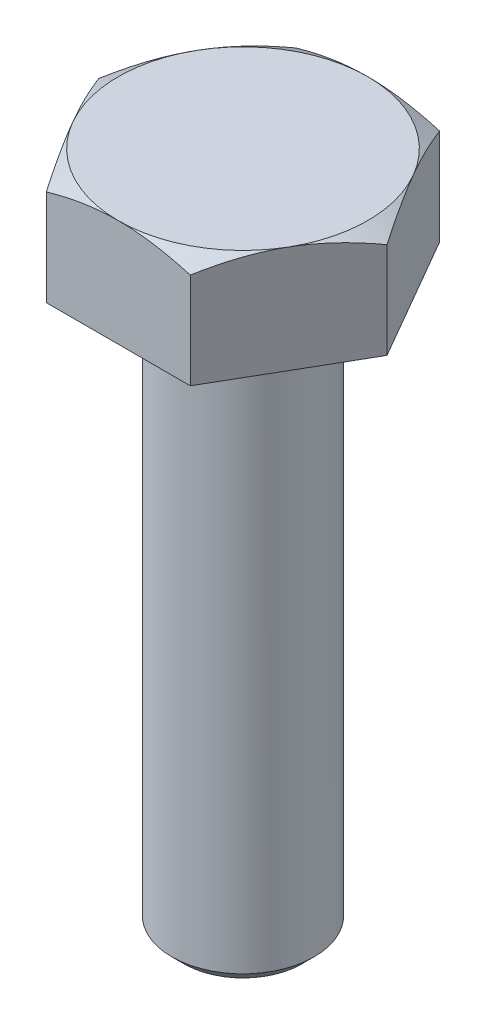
ISO-10303-21;
HEADER;
FILE_DESCRIPTION(('STEP AP214'),'2;1');
FILE_NAME('part.step','',(''),(''),'','','');
FILE_SCHEMA(('AUTOMOTIVE_DESIGN { 1 0 10303 214 1 1 1 1 }'));
ENDSEC;
DATA;
#1=APPLICATION_CONTEXT('core data for automotive mechanical design processes');
#2=APPLICATION_PROTOCOL_DEFINITION('international standard','automotive_design',2000,#1);
#3=PRODUCT_CONTEXT('',#1,'mechanical');
#4=PRODUCT('Part','Part','',(#3));
#5=PRODUCT_RELATED_PRODUCT_CATEGORY('part','',(#4));
#6=PRODUCT_DEFINITION_FORMATION('','',#4);
#7=PRODUCT_DEFINITION_CONTEXT('part definition',#1,'design');
#8=PRODUCT_DEFINITION('design','',#6,#7);
#9=PRODUCT_DEFINITION_SHAPE('','',#8);
#10=(LENGTH_UNIT() NAMED_UNIT(*) SI_UNIT(.MILLI.,.METRE.));
#11=(NAMED_UNIT(*) PLANE_ANGLE_UNIT() SI_UNIT($,.RADIAN.));
#12=(NAMED_UNIT(*) SI_UNIT($,.STERADIAN.) SOLID_ANGLE_UNIT());
#13=UNCERTAINTY_MEASURE_WITH_UNIT(LENGTH_MEASURE(1.E-05),#10,'distance_accuracy_value','');
#14=(GEOMETRIC_REPRESENTATION_CONTEXT(3) GLOBAL_UNCERTAINTY_ASSIGNED_CONTEXT((#13)) GLOBAL_UNIT_ASSIGNED_CONTEXT((#10,
#11,#12)) REPRESENTATION_CONTEXT('',''));
#15=CARTESIAN_POINT('',(0.,0.,0.));
#16=DIRECTION('',(0.,0.,1.));
#17=DIRECTION('',(1.,0.,0.));
#18=AXIS2_PLACEMENT_3D('',#15,#16,#17);
#19=CARTESIAN_POINT('',(0.,-25.4,0.));
#20=DIRECTION('',(0.,1.,0.));
#21=DIRECTION('',(0.,0.,1.));
#22=AXIS2_PLACEMENT_3D('',#19,#20,#21);
#23=CYLINDRICAL_SURFACE('',#22,3.175);
#24=CARTESIAN_POINT('',(0.,0.,0.));
#25=DIRECTION('',(0.,1.,0.));
#26=DIRECTION('',(0.,0.,1.));
#27=AXIS2_PLACEMENT_3D('',#24,#25,#26);
#28=CIRCLE('',#27,3.175);
#29=CARTESIAN_POINT('',(0.,0.,3.175));
#30=VERTEX_POINT('',#29);
#31=EDGE_CURVE('E12',#30,#30,#28,.F.);
#32=ORIENTED_EDGE('',*,*,#31,.T.);
#33=EDGE_LOOP('',(#32));
#34=FACE_BOUND('',#33,.T.);
#35=CARTESIAN_POINT('',(0.,-24.8588701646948,0.));
#36=DIRECTION('',(0.,1.,0.));
#37=DIRECTION('',(0.,0.,1.));
#38=AXIS2_PLACEMENT_3D('',#35,#36,#37);
#39=CIRCLE('',#38,3.175);
#40=CARTESIAN_POINT('',(0.,-24.8588701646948,3.175));
#41=VERTEX_POINT('',#40);
#42=EDGE_CURVE('E133',#41,#41,#39,.F.);
#43=ORIENTED_EDGE('',*,*,#42,.F.);
#44=EDGE_LOOP('',(#43));
#45=FACE_BOUND('',#44,.T.);
#46=ADVANCED_FACE('F38',(#34,#45),#23,.T.);
#47=CARTESIAN_POINT('',(3.21156860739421,4.7752,5.5626));
#48=DIRECTION('',(-0.866025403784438,0.,-0.5));
#49=DIRECTION('',(-0.5,0.,0.866025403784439));
#50=AXIS2_PLACEMENT_3D('',#47,#48,#49);
#51=PLANE('',#50);
#52=CARTESIAN_POINT('',(3.21145313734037,4.27830193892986,5.5628));
#53=CARTESIAN_POINT('',(3.28204724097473,4.31905379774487,5.44052742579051));
#54=CARTESIAN_POINT('',(3.35290455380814,4.35795622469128,5.31779895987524));
#55=CARTESIAN_POINT('',(3.49519461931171,4.43155283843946,5.07134533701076));
#56=CARTESIAN_POINT('',(3.56662760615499,4.46624520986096,4.9476197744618));
#57=CARTESIAN_POINT('',(3.78207031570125,4.56332629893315,4.57446205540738));
#58=CARTESIAN_POINT('',(3.92693047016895,4.61854515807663,4.32355690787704));
#59=CARTESIAN_POINT('',(4.14371105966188,4.68329621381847,3.94808191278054));
#60=CARTESIAN_POINT('',(4.21498376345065,4.70174200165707,3.8246339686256));
#61=CARTESIAN_POINT('',(4.3578512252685,4.73267310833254,3.57718026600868));
#62=CARTESIAN_POINT('',(4.42944595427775,4.74515895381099,3.45317455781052));
#63=CARTESIAN_POINT('',(4.57275976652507,4.76385197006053,3.20494775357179));
#64=CARTESIAN_POINT('',(4.64447861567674,4.77006626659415,3.08072706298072));
#65=CARTESIAN_POINT('',(4.78797861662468,4.7760895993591,2.8321777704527));
#66=CARTESIAN_POINT('',(4.85975976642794,4.7758988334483,2.70784917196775));
#67=CARTESIAN_POINT('',(5.05641945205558,4.76657189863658,2.36722460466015));
#68=CARTESIAN_POINT('',(5.18123362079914,4.75091260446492,2.15104012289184));
#69=CARTESIAN_POINT('',(5.4300329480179,4.70125567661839,1.72010704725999));
#70=CARTESIAN_POINT('',(5.55401723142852,4.66724106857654,1.50535996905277));
#71=CARTESIAN_POINT('',(5.80331731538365,4.58221395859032,1.0735595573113));
#72=CARTESIAN_POINT('',(5.92860165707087,4.5308411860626,0.856560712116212));
#73=CARTESIAN_POINT('',(6.17730193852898,4.4142455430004,0.425799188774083));
#74=CARTESIAN_POINT('',(6.30072106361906,4.34905006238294,0.212030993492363));
#75=CARTESIAN_POINT('',(6.42325268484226,4.27830193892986,-0.000199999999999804));
#76=B_SPLINE_CURVE_WITH_KNOTS('',3,(#52,#53,#54,#55,#56,#57,#58,#59,#60,#61,#62,#63,#64,#65,#66,
#67,#68,#69,#70,#71,#72,#73,#74,#75),.UNSPECIFIED.,.F.,.F.,(4,2,2,2,2,2,2,2,2,2,2,4),(0.,
0.44082011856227,0.881829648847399,1.76568130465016,2.19678242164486,2.62784543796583,
3.05841812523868,3.48897751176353,4.23854798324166,4.98881282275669,5.75571809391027,
6.52111769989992),.UNSPECIFIED.);
#77=CARTESIAN_POINT('',(3.21156860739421,4.27836860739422,5.5626));
#78=VERTEX_POINT('',#77);
#79=CARTESIAN_POINT('',(4.81735291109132,4.7752,2.7813));
#80=VERTEX_POINT('',#79);
#81=EDGE_CURVE('E113',#78,#80,#76,.T.);
#82=ORIENTED_EDGE('',*,*,#81,.F.);
#83=DIRECTION('',(0.,-1.,0.));
#84=VECTOR('',#83,1.);
#85=CARTESIAN_POINT('',(3.21156860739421,4.7752,5.5626));
#86=LINE('',#85,#84);
#87=CARTESIAN_POINT('',(3.21156860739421,0.,5.5626));
#88=VERTEX_POINT('',#87);
#89=EDGE_CURVE('E62',#78,#88,#86,.T.);
#90=ORIENTED_EDGE('',*,*,#89,.T.);
#91=DIRECTION('',(0.5,0.,-0.866025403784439));
#92=VECTOR('',#91,1.);
#93=CARTESIAN_POINT('',(3.21156860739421,0.,5.5626));
#94=LINE('',#93,#92);
#95=CARTESIAN_POINT('',(6.42313721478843,0.,0.));
#96=VERTEX_POINT('',#95);
#97=EDGE_CURVE('E120',#88,#96,#94,.T.);
#98=ORIENTED_EDGE('',*,*,#97,.T.);
#99=DIRECTION('',(0.,-1.,0.));
#100=VECTOR('',#99,1.);
#101=CARTESIAN_POINT('',(6.42313721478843,4.7752,0.));
#102=LINE('',#101,#100);
#103=CARTESIAN_POINT('',(6.42313721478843,4.27836860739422,0.));
#104=VERTEX_POINT('',#103);
#105=EDGE_CURVE('E136',#104,#96,#102,.T.);
#106=ORIENTED_EDGE('',*,*,#105,.F.);
#107=EDGE_CURVE('E121',#80,#104,#76,.T.);
#108=ORIENTED_EDGE('',*,*,#107,.F.);
#109=EDGE_LOOP('',(#82,#90,#98,#106,#108));
#110=FACE_BOUND('',#109,.T.);
#111=ADVANCED_FACE('F40',(#110),#51,.F.);
#112=CARTESIAN_POINT('',(6.42313721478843,4.7752,0.));
#113=DIRECTION('',(-0.866025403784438,0.,0.5));
#114=DIRECTION('',(0.5,0.,0.866025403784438));
#115=AXIS2_PLACEMENT_3D('',#112,#113,#114);
#116=PLANE('',#115);
#117=CARTESIAN_POINT('',(6.42325268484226,4.27830193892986,0.000200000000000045));
#118=CARTESIAN_POINT('',(6.35265858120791,4.31905379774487,-0.122072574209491));
#119=CARTESIAN_POINT('',(6.28180126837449,4.35795622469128,-0.244801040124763));
#120=CARTESIAN_POINT('',(6.13951120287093,4.43155283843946,-0.491254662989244));
#121=CARTESIAN_POINT('',(6.06807821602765,4.46624520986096,-0.614980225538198));
#122=CARTESIAN_POINT('',(5.85263550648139,4.56332629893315,-0.98813794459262));
#123=CARTESIAN_POINT('',(5.70777535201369,4.61854515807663,-1.23904309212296));
#124=CARTESIAN_POINT('',(5.49099476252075,4.68329621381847,-1.61451808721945));
#125=CARTESIAN_POINT('',(5.41972205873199,4.70174200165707,-1.7379660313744));
#126=CARTESIAN_POINT('',(5.27685459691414,4.73267310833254,-1.98541973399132));
#127=CARTESIAN_POINT('',(5.20525986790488,4.74515895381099,-2.10942544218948));
#128=CARTESIAN_POINT('',(5.06194605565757,4.76385197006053,-2.35765224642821));
#129=CARTESIAN_POINT('',(4.9902272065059,4.77006626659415,-2.48187293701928));
#130=CARTESIAN_POINT('',(4.84672720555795,4.7760895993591,-2.7304222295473));
#131=CARTESIAN_POINT('',(4.7749460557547,4.7758988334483,-2.85475082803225));
#132=CARTESIAN_POINT('',(4.57828637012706,4.76657189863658,-3.19537539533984));
#133=CARTESIAN_POINT('',(4.4534722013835,4.75091260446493,-3.41155987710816));
#134=CARTESIAN_POINT('',(4.20467287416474,4.7012556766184,-3.84249295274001));
#135=CARTESIAN_POINT('',(4.08068859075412,4.66724106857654,-4.05724003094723));
#136=CARTESIAN_POINT('',(3.83138850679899,4.58221395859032,-4.4890404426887));
#137=CARTESIAN_POINT('',(3.70610416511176,4.5308411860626,-4.70603928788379));
#138=CARTESIAN_POINT('',(3.45740388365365,4.41424554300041,-5.13680081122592));
#139=CARTESIAN_POINT('',(3.33398475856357,4.34905006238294,-5.35056900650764));
#140=CARTESIAN_POINT('',(3.21145313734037,4.27830193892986,-5.5628));
#141=B_SPLINE_CURVE_WITH_KNOTS('',3,(#117,#118,#119,#120,#121,#122,#123,#124,#125,#126,#127,
#128,#129,#130,#131,#132,#133,#134,#135,#136,#137,#138,#139,#140),.UNSPECIFIED.,.F.,.F.,(4,2,2,
2,2,2,2,2,2,2,2,4),(0.,0.440820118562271,0.8818296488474,1.76568130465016,2.19678242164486,
2.62784543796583,3.05841812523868,3.48897751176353,4.23854798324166,4.98881282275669,
5.75571809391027,6.52111769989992),.UNSPECIFIED.);
#142=CARTESIAN_POINT('',(4.81735291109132,4.7752,-2.7813));
#143=VERTEX_POINT('',#142);
#144=EDGE_CURVE('E127',#104,#143,#141,.T.);
#145=ORIENTED_EDGE('',*,*,#144,.F.);
#146=ORIENTED_EDGE('',*,*,#105,.T.);
#147=DIRECTION('',(-0.5,0.,-0.866025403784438));
#148=VECTOR('',#147,1.);
#149=CARTESIAN_POINT('',(6.42313721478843,0.,0.));
#150=LINE('',#149,#148);
#151=CARTESIAN_POINT('',(3.21156860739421,0.,-5.5626));
#152=VERTEX_POINT('',#151);
#153=EDGE_CURVE('E374',#96,#152,#150,.T.);
#154=ORIENTED_EDGE('',*,*,#153,.T.);
#155=DIRECTION('',(0.,-1.,0.));
#156=VECTOR('',#155,1.);
#157=CARTESIAN_POINT('',(3.21156860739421,4.7752,-5.5626));
#158=LINE('',#157,#156);
#159=CARTESIAN_POINT('',(3.21156860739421,4.27836860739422,-5.5626));
#160=VERTEX_POINT('',#159);
#161=EDGE_CURVE('E359',#160,#152,#158,.T.);
#162=ORIENTED_EDGE('',*,*,#161,.F.);
#163=EDGE_CURVE('E137',#143,#160,#141,.T.);
#164=ORIENTED_EDGE('',*,*,#163,.F.);
#165=EDGE_LOOP('',(#145,#146,#154,#162,#164));
#166=FACE_BOUND('',#165,.T.);
#167=ADVANCED_FACE('F189',(#166),#116,.F.);
#168=CARTESIAN_POINT('',(3.21156860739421,4.7752,-5.5626));
#169=DIRECTION('',(0.,0.,1.));
#170=DIRECTION('',(1.,0.,0.));
#171=AXIS2_PLACEMENT_3D('',#168,#169,#170);
#172=PLANE('',#171);
#173=CARTESIAN_POINT('',(-8.76973212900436,1.99091669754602,-5.5626));
#174=CARTESIAN_POINT('',(-8.52551061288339,2.10995424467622,-5.5626));
#175=CARTESIAN_POINT('',(-8.28074354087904,2.22789095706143,-5.5626));
#176=CARTESIAN_POINT('',(-7.78982863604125,2.4609462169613,-5.5626));
#177=CARTESIAN_POINT('',(-7.54368060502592,2.57606434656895,-5.5626));
#178=CARTESIAN_POINT('',(-7.0485135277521,2.80341471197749,-5.5626));
#179=CARTESIAN_POINT('',(-6.79948622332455,2.91562902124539,-5.5626));
#180=CARTESIAN_POINT('',(-6.2995000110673,3.1356518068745,-5.5626));
#181=CARTESIAN_POINT('',(-6.04854119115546,3.24346048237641,-5.5626));
#182=CARTESIAN_POINT('',(-5.53572307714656,3.45708338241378,-5.5626));
#183=CARTESIAN_POINT('',(-5.27378322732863,3.56270524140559,-5.5626));
#184=CARTESIAN_POINT('',(-4.74689218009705,3.76629592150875,-5.5626));
#185=CARTESIAN_POINT('',(-4.48194065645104,3.86426390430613,-5.5626));
#186=CARTESIAN_POINT('',(-3.94905678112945,4.05007995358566,-5.5626));
#187=CARTESIAN_POINT('',(-3.68113122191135,4.13794731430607,-5.5626));
#188=CARTESIAN_POINT('',(-3.14143655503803,4.30083694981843,-5.5626));
#189=CARTESIAN_POINT('',(-2.86966864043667,4.3758631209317,-5.5626));
#190=CARTESIAN_POINT('',(-2.32365421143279,4.50916990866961,-5.5626));
#191=CARTESIAN_POINT('',(-2.04943102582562,4.56754459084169,-5.5626));
#192=CARTESIAN_POINT('',(-1.49739087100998,4.66433060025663,-5.5626));
#193=CARTESIAN_POINT('',(-1.21957429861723,4.70274411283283,-5.5626));
#194=CARTESIAN_POINT('',(-0.803108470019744,4.74285072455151,-5.5626));
#195=CARTESIAN_POINT('',(-0.665268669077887,4.75328762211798,-5.5626));
#196=CARTESIAN_POINT('',(-0.389275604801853,4.7683212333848,-5.5626));
#197=CARTESIAN_POINT('',(-0.251122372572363,4.77291850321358,-5.5626));
#198=CARTESIAN_POINT('',(0.025265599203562,4.77615799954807,-5.5626));
#199=CARTESIAN_POINT('',(0.163500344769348,4.77479971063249,-5.5626));
#200=CARTESIAN_POINT('',(0.439775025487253,4.76616372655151,-5.5626));
#201=CARTESIAN_POINT('',(0.577814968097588,4.75888626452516,-5.5626));
#202=CARTESIAN_POINT('',(0.905282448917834,4.73475810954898,-5.5626));
#203=CARTESIAN_POINT('',(1.09452497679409,4.71533742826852,-5.5626));
#204=CARTESIAN_POINT('',(1.47168951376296,4.66639851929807,-5.5626));
#205=CARTESIAN_POINT('',(1.65961135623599,4.63687904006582,-5.5626));
#206=CARTESIAN_POINT('',(2.22112839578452,4.53473083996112,-5.5626));
#207=CARTESIAN_POINT('',(2.5922916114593,4.44852773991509,-5.5626));
#208=CARTESIAN_POINT('',(3.14759286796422,4.29794485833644,-5.5626));
#209=CARTESIAN_POINT('',(3.33457905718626,4.24345465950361,-5.5626));
#210=CARTESIAN_POINT('',(3.70673790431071,4.12854280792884,-5.5626));
#211=CARTESIAN_POINT('',(3.89191054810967,4.06812110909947,-5.5626));
#212=CARTESIAN_POINT('',(4.26049752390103,3.94233813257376,-5.5626));
#213=CARTESIAN_POINT('',(4.44391232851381,3.87697822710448,-5.5626));
#214=CARTESIAN_POINT('',(4.80920226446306,3.74211496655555,-5.5626));
#215=CARTESIAN_POINT('',(4.99107743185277,3.67261170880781,-5.5626));
#216=CARTESIAN_POINT('',(5.48321451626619,3.47913969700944,-5.5626));
#217=CARTESIAN_POINT('',(5.79215313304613,3.35180791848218,-5.5626));
#218=CARTESIAN_POINT('',(6.40681985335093,3.08959037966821,-5.5626));
#219=CARTESIAN_POINT('',(6.71254758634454,2.95470375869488,-5.5626));
#220=CARTESIAN_POINT('',(7.32153523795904,2.67917588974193,-5.5626));
#221=CARTESIAN_POINT('',(7.62479413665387,2.5385323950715,-5.5626));
#222=CARTESIAN_POINT('',(8.22922453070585,2.25287647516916,-5.5626));
#223=CARTESIAN_POINT('',(8.53039611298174,2.10786423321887,-5.5626));
#224=CARTESIAN_POINT('',(9.13156127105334,1.81418879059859,-5.5626));
#225=CARTESIAN_POINT('',(9.43155211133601,1.66552000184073,-5.5626));
#226=CARTESIAN_POINT('',(10.030173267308,1.36546684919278,-5.5626));
#227=CARTESIAN_POINT('',(10.3288035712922,1.21408246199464,-5.5626));
#228=CARTESIAN_POINT('',(11.2228997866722,0.756759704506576,-5.5626));
#229=CARTESIAN_POINT('',(11.8167088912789,0.447583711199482,-5.5626));
#230=CARTESIAN_POINT('',(12.9379917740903,-0.143172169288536,-5.5626));
#231=CARTESIAN_POINT('',(13.4657734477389,-0.424170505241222,-5.5626));
#232=CARTESIAN_POINT('',(14.5195679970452,-0.989542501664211,-5.5626));
#233=CARTESIAN_POINT('',(15.0455807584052,-1.27391637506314,-5.5626));
#234=CARTESIAN_POINT('',(16.0944575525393,-1.84418560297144,-5.5626));
#235=CARTESIAN_POINT('',(16.6173262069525,-2.13007247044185,-5.5626));
#236=CARTESIAN_POINT('',(17.6619597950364,-2.7037569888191,-5.5626));
#237=CARTESIAN_POINT('',(18.1837248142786,-2.9915544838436,-5.5626));
#238=CARTESIAN_POINT('',(18.705102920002,-3.28004688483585,-5.5626));
#239=B_SPLINE_CURVE_WITH_KNOTS('',3,(#173,#174,#175,#176,#177,#178,#179,#180,#181,#182,#183,
#184,#185,#186,#187,#188,#189,#190,#191,#192,#193,#194,#195,#196,#197,#198,#199,#200,#201,#202,
#203,#204,#205,#206,#207,#208,#209,#210,#211,#212,#213,#214,#215,#216,#217,#218,#219,#220,#221,
#222,#223,#224,#225,#226,#227,#228,#229,#230,#231,#232,#233,#234,#235,#236,#237,#238),
.UNSPECIFIED.,.F.,.F.,(4,2,2,2,2,2,2,2,2,2,2,2,2,2,2,2,2,2,2,2,2,2,2,2,2,2,2,2,2,2,2,2,4),(0.,
0.815071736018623,1.63026359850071,2.44965589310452,3.26901110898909,4.11621802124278,
4.96351759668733,5.80917077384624,6.65456690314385,7.49508820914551,8.3355174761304,
8.75011570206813,9.16467444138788,9.57926905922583,9.99384734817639,10.5642375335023,
11.1346984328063,12.276170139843,12.8604093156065,13.4446530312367,14.0287349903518,
14.6128032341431,15.6151033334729,16.6175178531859,17.6203273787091,18.6230948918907,
19.6275039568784,20.6319216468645,22.640295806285,24.4340565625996,26.2279310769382,
28.0156925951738,29.8033100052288),.UNSPECIFIED.);
#240=CARTESIAN_POINT('',(0.,4.7752,-5.5626));
#241=VERTEX_POINT('',#240);
#242=EDGE_CURVE('E183',#160,#241,#239,.F.);
#243=ORIENTED_EDGE('',*,*,#242,.F.);
#244=ORIENTED_EDGE('',*,*,#161,.T.);
#245=DIRECTION('',(-1.,0.,0.));
#246=VECTOR('',#245,1.);
#247=CARTESIAN_POINT('',(3.21156860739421,0.,-5.5626));
#248=LINE('',#247,#246);
#249=CARTESIAN_POINT('',(-3.21156860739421,0.,-5.5626));
#250=VERTEX_POINT('',#249);
#251=EDGE_CURVE('E357',#152,#250,#248,.T.);
#252=ORIENTED_EDGE('',*,*,#251,.T.);
#253=DIRECTION('',(0.,-1.,0.));
#254=VECTOR('',#253,1.);
#255=CARTESIAN_POINT('',(-3.21156860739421,4.7752,-5.5626));
#256=LINE('',#255,#254);
#257=CARTESIAN_POINT('',(-3.21156860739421,4.27836860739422,-5.5626));
#258=VERTEX_POINT('',#257);
#259=EDGE_CURVE('E349',#258,#250,#256,.T.);
#260=ORIENTED_EDGE('',*,*,#259,.F.);
#261=EDGE_CURVE('E178',#241,#258,#239,.F.);
#262=ORIENTED_EDGE('',*,*,#261,.F.);
#263=EDGE_LOOP('',(#243,#244,#252,#260,#262));
#264=FACE_BOUND('',#263,.T.);
#265=ADVANCED_FACE('F185',(#264),#172,.F.);
#266=CARTESIAN_POINT('',(-3.21156860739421,4.7752,-5.5626));
#267=DIRECTION('',(0.866025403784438,0.,0.5));
#268=DIRECTION('',(0.5,0.,-0.866025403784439));
#269=AXIS2_PLACEMENT_3D('',#266,#267,#268);
#270=PLANE('',#269);
#271=CARTESIAN_POINT('',(-3.21145313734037,4.27830193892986,-5.5628));
#272=CARTESIAN_POINT('',(-3.28204724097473,4.31905379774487,-5.44052742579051));
#273=CARTESIAN_POINT('',(-3.35290455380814,4.35795622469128,-5.31779895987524));
#274=CARTESIAN_POINT('',(-3.49519461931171,4.43155283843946,-5.07134533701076));
#275=CARTESIAN_POINT('',(-3.56662760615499,4.46624520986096,-4.9476197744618));
#276=CARTESIAN_POINT('',(-3.78207031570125,4.56332629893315,-4.57446205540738));
#277=CARTESIAN_POINT('',(-3.92693047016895,4.61854515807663,-4.32355690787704));
#278=CARTESIAN_POINT('',(-4.14371105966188,4.68329621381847,-3.94808191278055));
#279=CARTESIAN_POINT('',(-4.21498376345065,4.70174200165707,-3.8246339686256));
#280=CARTESIAN_POINT('',(-4.3578512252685,4.73267310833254,-3.57718026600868));
#281=CARTESIAN_POINT('',(-4.42944595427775,4.74515895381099,-3.45317455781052));
#282=CARTESIAN_POINT('',(-4.57275976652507,4.76385197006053,-3.20494775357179));
#283=CARTESIAN_POINT('',(-4.64447861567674,4.77006626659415,-3.08072706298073));
#284=CARTESIAN_POINT('',(-4.78797861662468,4.7760895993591,-2.8321777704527));
#285=CARTESIAN_POINT('',(-4.85975976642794,4.7758988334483,-2.70784917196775));
#286=CARTESIAN_POINT('',(-5.05641945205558,4.76657189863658,-2.36722460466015));
#287=CARTESIAN_POINT('',(-5.18123362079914,4.75091260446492,-2.15104012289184));
#288=CARTESIAN_POINT('',(-5.4300329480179,4.70125567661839,-1.72010704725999));
#289=CARTESIAN_POINT('',(-5.55401723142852,4.66724106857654,-1.50535996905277));
#290=CARTESIAN_POINT('',(-5.80331731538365,4.58221395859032,-1.0735595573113));
#291=CARTESIAN_POINT('',(-5.92860165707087,4.5308411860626,-0.856560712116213));
#292=CARTESIAN_POINT('',(-6.17730193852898,4.4142455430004,-0.425799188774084));
#293=CARTESIAN_POINT('',(-6.30072106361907,4.34905006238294,-0.212030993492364));
#294=CARTESIAN_POINT('',(-6.42325268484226,4.27830193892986,0.000199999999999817));
#295=B_SPLINE_CURVE_WITH_KNOTS('',3,(#271,#272,#273,#274,#275,#276,#277,#278,#279,#280,#281,
#282,#283,#284,#285,#286,#287,#288,#289,#290,#291,#292,#293,#294),.UNSPECIFIED.,.F.,.F.,(4,2,2,
2,2,2,2,2,2,2,2,4),(0.,0.44082011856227,0.881829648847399,1.76568130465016,2.19678242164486,
2.62784543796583,3.05841812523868,3.48897751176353,4.23854798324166,4.98881282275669,
5.75571809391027,6.52111769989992),.UNSPECIFIED.);
#296=CARTESIAN_POINT('',(-4.81735291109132,4.7752,-2.7813));
#297=VERTEX_POINT('',#296);
#298=EDGE_CURVE('E184',#258,#297,#295,.T.);
#299=ORIENTED_EDGE('',*,*,#298,.F.);
#300=ORIENTED_EDGE('',*,*,#259,.T.);
#301=DIRECTION('',(-0.5,0.,0.866025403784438));
#302=VECTOR('',#301,1.);
#303=CARTESIAN_POINT('',(-3.21156860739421,0.,-5.5626));
#304=LINE('',#303,#302);
#305=CARTESIAN_POINT('',(-6.42313721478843,0.,0.));
#306=VERTEX_POINT('',#305);
#307=EDGE_CURVE('E378',#250,#306,#304,.T.);
#308=ORIENTED_EDGE('',*,*,#307,.T.);
#309=DIRECTION('',(0.,-1.,0.));
#310=VECTOR('',#309,1.);
#311=CARTESIAN_POINT('',(-6.42313721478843,4.7752,0.));
#312=LINE('',#311,#310);
#313=CARTESIAN_POINT('',(-6.42313721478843,4.27836860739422,0.));
#314=VERTEX_POINT('',#313);
#315=EDGE_CURVE('E360',#314,#306,#312,.T.);
#316=ORIENTED_EDGE('',*,*,#315,.F.);
#317=EDGE_CURVE('E173',#297,#314,#295,.T.);
#318=ORIENTED_EDGE('',*,*,#317,.F.);
#319=EDGE_LOOP('',(#299,#300,#308,#316,#318));
#320=FACE_BOUND('',#319,.T.);
#321=ADVANCED_FACE('F188',(#320),#270,.F.);
#322=CARTESIAN_POINT('',(-6.42313721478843,4.7752,0.));
#323=DIRECTION('',(0.866025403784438,0.,-0.5));
#324=DIRECTION('',(-0.5,0.,-0.866025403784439));
#325=AXIS2_PLACEMENT_3D('',#322,#323,#324);
#326=PLANE('',#325);
#327=CARTESIAN_POINT('',(-6.42325268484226,4.27830193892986,-0.000200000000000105));
#328=CARTESIAN_POINT('',(-6.35265858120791,4.31905379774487,0.122072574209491));
#329=CARTESIAN_POINT('',(-6.28180126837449,4.35795622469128,0.244801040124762));
#330=CARTESIAN_POINT('',(-6.13951120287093,4.43155283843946,0.491254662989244));
#331=CARTESIAN_POINT('',(-6.06807821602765,4.46624520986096,0.614980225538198));
#332=CARTESIAN_POINT('',(-5.85263550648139,4.56332629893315,0.988137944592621));
#333=CARTESIAN_POINT('',(-5.70777535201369,4.61854515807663,1.23904309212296));
#334=CARTESIAN_POINT('',(-5.49099476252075,4.68329621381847,1.61451808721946));
#335=CARTESIAN_POINT('',(-5.41972205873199,4.70174200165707,1.7379660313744));
#336=CARTESIAN_POINT('',(-5.27685459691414,4.73267310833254,1.98541973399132));
#337=CARTESIAN_POINT('',(-5.20525986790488,4.74515895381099,2.10942544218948));
#338=CARTESIAN_POINT('',(-5.06194605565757,4.76385197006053,2.35765224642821));
#339=CARTESIAN_POINT('',(-4.9902272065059,4.77006626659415,2.48187293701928));
#340=CARTESIAN_POINT('',(-4.84672720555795,4.7760895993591,2.7304222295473));
#341=CARTESIAN_POINT('',(-4.7749460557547,4.7758988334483,2.85475082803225));
#342=CARTESIAN_POINT('',(-4.57828637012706,4.76657189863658,3.19537539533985));
#343=CARTESIAN_POINT('',(-4.4534722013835,4.75091260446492,3.41155987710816));
#344=CARTESIAN_POINT('',(-4.20467287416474,4.70125567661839,3.84249295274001));
#345=CARTESIAN_POINT('',(-4.08068859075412,4.66724106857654,4.05724003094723));
#346=CARTESIAN_POINT('',(-3.83138850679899,4.58221395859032,4.4890404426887));
#347=CARTESIAN_POINT('',(-3.70610416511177,4.5308411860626,4.70603928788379));
#348=CARTESIAN_POINT('',(-3.45740388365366,4.4142455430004,5.13680081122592));
#349=CARTESIAN_POINT('',(-3.33398475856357,4.34905006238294,5.35056900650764));
#350=CARTESIAN_POINT('',(-3.21145313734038,4.27830193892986,5.5628));
#351=B_SPLINE_CURVE_WITH_KNOTS('',3,(#327,#328,#329,#330,#331,#332,#333,#334,#335,#336,#337,
#338,#339,#340,#341,#342,#343,#344,#345,#346,#347,#348,#349,#350),.UNSPECIFIED.,.F.,.F.,(4,2,2,
2,2,2,2,2,2,2,2,4),(0.,0.44082011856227,0.8818296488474,1.76568130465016,2.19678242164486,
2.62784543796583,3.05841812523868,3.48897751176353,4.23854798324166,4.98881282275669,
5.75571809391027,6.52111769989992),.UNSPECIFIED.);
#352=CARTESIAN_POINT('',(-4.81735291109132,4.7752,2.7813));
#353=VERTEX_POINT('',#352);
#354=EDGE_CURVE('E392',#314,#353,#351,.T.);
#355=ORIENTED_EDGE('',*,*,#354,.F.);
#356=ORIENTED_EDGE('',*,*,#315,.T.);
#357=DIRECTION('',(0.5,0.,0.866025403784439));
#358=VECTOR('',#357,1.);
#359=CARTESIAN_POINT('',(-6.42313721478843,0.,0.));
#360=LINE('',#359,#358);
#361=CARTESIAN_POINT('',(-3.21156860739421,0.,5.5626));
#362=VERTEX_POINT('',#361);
#363=EDGE_CURVE('E380',#306,#362,#360,.T.);
#364=ORIENTED_EDGE('',*,*,#363,.T.);
#365=DIRECTION('',(0.,-1.,0.));
#366=VECTOR('',#365,1.);
#367=CARTESIAN_POINT('',(-3.21156860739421,4.7752,5.5626));
#368=LINE('',#367,#366);
#369=CARTESIAN_POINT('',(-3.21156860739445,4.27836860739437,5.5626));
#370=VERTEX_POINT('',#369);
#371=EDGE_CURVE('E363',#370,#362,#368,.T.);
#372=ORIENTED_EDGE('',*,*,#371,.F.);
#373=EDGE_CURVE('E167',#353,#370,#351,.T.);
#374=ORIENTED_EDGE('',*,*,#373,.F.);
#375=EDGE_LOOP('',(#355,#356,#364,#372,#374));
#376=FACE_BOUND('',#375,.T.);
#377=ADVANCED_FACE('F275',(#376),#326,.F.);
#378=CARTESIAN_POINT('',(-3.21156860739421,4.7752,5.5626));
#379=DIRECTION('',(0.,0.,-1.));
#380=DIRECTION('',(-1.,0.,0.));
#381=AXIS2_PLACEMENT_3D('',#378,#379,#380);
#382=PLANE('',#381);
#383=CARTESIAN_POINT('',(-8.76973212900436,1.99091669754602,5.5626));
#384=CARTESIAN_POINT('',(-8.52551061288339,2.10995424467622,5.5626));
#385=CARTESIAN_POINT('',(-8.28074354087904,2.22789095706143,5.5626));
#386=CARTESIAN_POINT('',(-7.78982863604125,2.4609462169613,5.5626));
#387=CARTESIAN_POINT('',(-7.54368060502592,2.57606434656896,5.5626));
#388=CARTESIAN_POINT('',(-7.0485135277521,2.80341471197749,5.5626));
#389=CARTESIAN_POINT('',(-6.79948622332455,2.91562902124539,5.5626));
#390=CARTESIAN_POINT('',(-6.2995000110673,3.1356518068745,5.5626));
#391=CARTESIAN_POINT('',(-6.04854119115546,3.24346048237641,5.5626));
#392=CARTESIAN_POINT('',(-5.53572307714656,3.45708338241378,5.5626));
#393=CARTESIAN_POINT('',(-5.27378322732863,3.56270524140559,5.5626));
#394=CARTESIAN_POINT('',(-4.74689218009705,3.76629592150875,5.5626));
#395=CARTESIAN_POINT('',(-4.48194065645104,3.86426390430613,5.5626));
#396=CARTESIAN_POINT('',(-3.94905678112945,4.05007995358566,5.5626));
#397=CARTESIAN_POINT('',(-3.68113122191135,4.13794731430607,5.5626));
#398=CARTESIAN_POINT('',(-3.14143655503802,4.30083694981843,5.5626));
#399=CARTESIAN_POINT('',(-2.86966864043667,4.3758631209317,5.5626));
#400=CARTESIAN_POINT('',(-2.32365421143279,4.50916990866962,5.5626));
#401=CARTESIAN_POINT('',(-2.04943102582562,4.56754459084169,5.5626));
#402=CARTESIAN_POINT('',(-1.49739087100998,4.66433060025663,5.5626));
#403=CARTESIAN_POINT('',(-1.21957429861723,4.70274411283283,5.5626));
#404=CARTESIAN_POINT('',(-0.803108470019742,4.74285072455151,5.5626));
#405=CARTESIAN_POINT('',(-0.665268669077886,4.75328762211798,5.5626));
#406=CARTESIAN_POINT('',(-0.389275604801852,4.7683212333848,5.5626));
#407=CARTESIAN_POINT('',(-0.251122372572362,4.77291850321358,5.5626));
#408=CARTESIAN_POINT('',(0.0252655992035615,4.77615799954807,5.5626));
#409=CARTESIAN_POINT('',(0.163500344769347,4.77479971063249,5.5626));
#410=CARTESIAN_POINT('',(0.439775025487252,4.76616372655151,5.5626));
#411=CARTESIAN_POINT('',(0.577814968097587,4.75888626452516,5.5626));
#412=CARTESIAN_POINT('',(0.905282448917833,4.73475810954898,5.5626));
#413=CARTESIAN_POINT('',(1.09452497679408,4.71533742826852,5.5626));
#414=CARTESIAN_POINT('',(1.47168951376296,4.66639851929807,5.5626));
#415=CARTESIAN_POINT('',(1.65961135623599,4.63687904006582,5.5626));
#416=CARTESIAN_POINT('',(2.22112839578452,4.53473083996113,5.5626));
#417=CARTESIAN_POINT('',(2.5922916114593,4.4485277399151,5.5626));
#418=CARTESIAN_POINT('',(3.14759286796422,4.29794485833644,5.5626));
#419=CARTESIAN_POINT('',(3.33457905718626,4.24345465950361,5.5626));
#420=CARTESIAN_POINT('',(3.70673790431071,4.12854280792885,5.5626));
#421=CARTESIAN_POINT('',(3.89191054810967,4.06812110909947,5.5626));
#422=CARTESIAN_POINT('',(4.26049752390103,3.94233813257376,5.5626));
#423=CARTESIAN_POINT('',(4.44391232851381,3.87697822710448,5.5626));
#424=CARTESIAN_POINT('',(4.80920226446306,3.74211496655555,5.5626));
#425=CARTESIAN_POINT('',(4.99107743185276,3.67261170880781,5.5626));
#426=CARTESIAN_POINT('',(5.48321451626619,3.47913969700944,5.5626));
#427=CARTESIAN_POINT('',(5.79215313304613,3.35180791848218,5.5626));
#428=CARTESIAN_POINT('',(6.40681985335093,3.08959037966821,5.5626));
#429=CARTESIAN_POINT('',(6.71254758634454,2.95470375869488,5.5626));
#430=CARTESIAN_POINT('',(7.32153523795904,2.67917588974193,5.5626));
#431=CARTESIAN_POINT('',(7.62479413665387,2.5385323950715,5.5626));
#432=CARTESIAN_POINT('',(8.22922453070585,2.25287647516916,5.5626));
#433=CARTESIAN_POINT('',(8.53039611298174,2.10786423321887,5.5626));
#434=CARTESIAN_POINT('',(9.13156127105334,1.81418879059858,5.5626));
#435=CARTESIAN_POINT('',(9.43155211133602,1.66552000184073,5.5626));
#436=CARTESIAN_POINT('',(10.030173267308,1.36546684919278,5.5626));
#437=CARTESIAN_POINT('',(10.3288035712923,1.21408246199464,5.5626));
#438=CARTESIAN_POINT('',(11.2228997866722,0.756759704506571,5.5626));
#439=CARTESIAN_POINT('',(11.8167088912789,0.447583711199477,5.5626));
#440=CARTESIAN_POINT('',(12.9379917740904,-0.143172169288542,5.5626));
#441=CARTESIAN_POINT('',(13.4657734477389,-0.424170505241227,5.5626));
#442=CARTESIAN_POINT('',(14.5195679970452,-0.989542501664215,5.5626));
#443=CARTESIAN_POINT('',(15.0455807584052,-1.27391637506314,5.5626));
#444=CARTESIAN_POINT('',(16.0944575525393,-1.84418560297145,5.5626));
#445=CARTESIAN_POINT('',(16.6173262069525,-2.13007247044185,5.5626));
#446=CARTESIAN_POINT('',(17.6619597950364,-2.70375698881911,5.5626));
#447=CARTESIAN_POINT('',(18.1837248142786,-2.99155448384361,5.5626));
#448=CARTESIAN_POINT('',(18.705102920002,-3.28004688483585,5.5626));
#449=B_SPLINE_CURVE_WITH_KNOTS('',3,(#383,#384,#385,#386,#387,#388,#389,#390,#391,#392,#393,
#394,#395,#396,#397,#398,#399,#400,#401,#402,#403,#404,#405,#406,#407,#408,#409,#410,#411,#412,
#413,#414,#415,#416,#417,#418,#419,#420,#421,#422,#423,#424,#425,#426,#427,#428,#429,#430,#431,
#432,#433,#434,#435,#436,#437,#438,#439,#440,#441,#442,#443,#444,#445,#446,#447,#448),
.UNSPECIFIED.,.F.,.F.,(4,2,2,2,2,2,2,2,2,2,2,2,2,2,2,2,2,2,2,2,2,2,2,2,2,2,2,2,2,2,2,2,4),(0.,
0.815071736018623,1.63026359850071,2.44965589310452,3.26901110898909,4.11621802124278,
4.96351759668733,5.80917077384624,6.65456690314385,7.49508820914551,8.3355174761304,
8.75011570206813,9.16467444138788,9.57926905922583,9.99384734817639,10.5642375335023,
11.1346984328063,12.276170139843,12.8604093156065,13.4446530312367,14.0287349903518,
14.612803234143,15.6151033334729,16.6175178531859,17.6203273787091,18.6230948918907,
19.6275039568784,20.6319216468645,22.6402958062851,24.4340565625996,26.2279310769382,
28.0156925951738,29.8033100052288),.UNSPECIFIED.);
#450=CARTESIAN_POINT('',(0.,4.7752,5.5626));
#451=VERTEX_POINT('',#450);
#452=EDGE_CURVE('E390',#370,#451,#449,.T.);
#453=ORIENTED_EDGE('',*,*,#452,.F.);
#454=ORIENTED_EDGE('',*,*,#371,.T.);
#455=DIRECTION('',(1.,0.,0.));
#456=VECTOR('',#455,1.);
#457=CARTESIAN_POINT('',(-3.21156860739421,0.,5.5626));
#458=LINE('',#457,#456);
#459=EDGE_CURVE('E385',#362,#88,#458,.T.);
#460=ORIENTED_EDGE('',*,*,#459,.T.);
#461=ORIENTED_EDGE('',*,*,#89,.F.);
#462=EDGE_CURVE('E118',#451,#78,#449,.T.);
#463=ORIENTED_EDGE('',*,*,#462,.F.);
#464=EDGE_LOOP('',(#453,#454,#460,#461,#463));
#465=FACE_BOUND('',#464,.T.);
#466=ADVANCED_FACE('F268',(#465),#382,.F.);
#467=CARTESIAN_POINT('',(0.,0.,0.));
#468=DIRECTION('',(0.,1.,0.));
#469=DIRECTION('',(0.,0.,1.));
#470=AXIS2_PLACEMENT_3D('',#467,#468,#469);
#471=PLANE('',#470);
#472=ORIENTED_EDGE('',*,*,#31,.F.);
#473=EDGE_LOOP('',(#472));
#474=FACE_BOUND('',#473,.T.);
#475=ORIENTED_EDGE('',*,*,#97,.F.);
#476=ORIENTED_EDGE('',*,*,#459,.F.);
#477=ORIENTED_EDGE('',*,*,#363,.F.);
#478=ORIENTED_EDGE('',*,*,#307,.F.);
#479=ORIENTED_EDGE('',*,*,#251,.F.);
#480=ORIENTED_EDGE('',*,*,#153,.F.);
#481=EDGE_LOOP('',(#475,#476,#477,#478,#479,#480));
#482=FACE_BOUND('',#481,.T.);
#483=ADVANCED_FACE('F261',(#474,#482),#471,.F.);
#484=CARTESIAN_POINT('',(0.,4.7752,0.));
#485=DIRECTION('',(0.,-1.,0.));
#486=DIRECTION('',(0.,0.,1.));
#487=AXIS2_PLACEMENT_3D('',#484,#485,#486);
#488=CONICAL_SURFACE('',#487,5.5626,1.0471975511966);
#489=ORIENTED_EDGE('',*,*,#373,.T.);
#490=ORIENTED_EDGE('',*,*,#452,.T.);
#491=CARTESIAN_POINT('',(0.,4.7752,0.));
#492=DIRECTION('',(0.,1.,0.));
#493=DIRECTION('',(0.,0.,1.));
#494=AXIS2_PLACEMENT_3D('',#491,#492,#493);
#495=CIRCLE('',#494,5.5626);
#496=EDGE_CURVE('E54',#353,#451,#495,.T.);
#497=ORIENTED_EDGE('',*,*,#496,.F.);
#498=EDGE_LOOP('',(#489,#490,#497));
#499=FACE_BOUND('',#498,.T.);
#500=ADVANCED_FACE('F153',(#499),#488,.T.);
#501=ORIENTED_EDGE('',*,*,#317,.T.);
#502=ORIENTED_EDGE('',*,*,#354,.T.);
#503=EDGE_CURVE('E367',#297,#353,#495,.T.);
#504=ORIENTED_EDGE('',*,*,#503,.F.);
#505=EDGE_LOOP('',(#501,#502,#504));
#506=FACE_BOUND('',#505,.T.);
#507=ADVANCED_FACE('F248',(#506),#488,.T.);
#508=ORIENTED_EDGE('',*,*,#261,.T.);
#509=ORIENTED_EDGE('',*,*,#298,.T.);
#510=EDGE_CURVE('E368',#241,#297,#495,.T.);
#511=ORIENTED_EDGE('',*,*,#510,.F.);
#512=EDGE_LOOP('',(#508,#509,#511));
#513=FACE_BOUND('',#512,.T.);
#514=ADVANCED_FACE('F241',(#513),#488,.T.);
#515=ORIENTED_EDGE('',*,*,#163,.T.);
#516=ORIENTED_EDGE('',*,*,#242,.T.);
#517=EDGE_CURVE('E131',#143,#241,#495,.T.);
#518=ORIENTED_EDGE('',*,*,#517,.F.);
#519=EDGE_LOOP('',(#515,#516,#518));
#520=FACE_BOUND('',#519,.T.);
#521=ADVANCED_FACE('F235',(#520),#488,.T.);
#522=ORIENTED_EDGE('',*,*,#107,.T.);
#523=ORIENTED_EDGE('',*,*,#144,.T.);
#524=EDGE_CURVE('E47',#80,#143,#495,.T.);
#525=ORIENTED_EDGE('',*,*,#524,.F.);
#526=EDGE_LOOP('',(#522,#523,#525));
#527=FACE_BOUND('',#526,.T.);
#528=ADVANCED_FACE('F125',(#527),#488,.T.);
#529=ORIENTED_EDGE('',*,*,#81,.T.);
#530=CARTESIAN_POINT('',(0.,4.7752,0.));
#531=DIRECTION('',(0.,1.,0.));
#532=DIRECTION('',(0.,0.,1.));
#533=AXIS2_PLACEMENT_3D('',#530,#531,#532);
#534=CIRCLE('',#533,5.5626);
#535=EDGE_CURVE('E116',#451,#80,#534,.T.);
#536=ORIENTED_EDGE('',*,*,#535,.F.);
#537=ORIENTED_EDGE('',*,*,#462,.T.);
#538=EDGE_LOOP('',(#529,#536,#537));
#539=FACE_BOUND('',#538,.T.);
#540=ADVANCED_FACE('F115',(#539),#488,.T.);
#541=CARTESIAN_POINT('',(0.,4.7752,0.));
#542=DIRECTION('',(0.,1.,0.));
#543=DIRECTION('',(0.,0.,1.));
#544=AXIS2_PLACEMENT_3D('',#541,#542,#543);
#545=PLANE('',#544);
#546=ORIENTED_EDGE('',*,*,#496,.T.);
#547=ORIENTED_EDGE('',*,*,#535,.T.);
#548=ORIENTED_EDGE('',*,*,#524,.T.);
#549=ORIENTED_EDGE('',*,*,#517,.T.);
#550=ORIENTED_EDGE('',*,*,#510,.T.);
#551=ORIENTED_EDGE('',*,*,#503,.T.);
#552=EDGE_LOOP('',(#546,#547,#548,#549,#550,#551));
#553=FACE_BOUND('',#552,.T.);
#554=ADVANCED_FACE('F132',(#553),#545,.T.);
#555=CARTESIAN_POINT('',(0.,-25.4,0.));
#556=DIRECTION('',(0.,1.,0.));
#557=DIRECTION('',(0.,0.,-1.));
#558=AXIS2_PLACEMENT_3D('',#555,#556,#557);
#559=CONICAL_SURFACE('',#558,2.63387016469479,0.78539816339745);
#560=CARTESIAN_POINT('',(0.,-25.4,0.));
#561=DIRECTION('',(0.,-1.,0.));
#562=DIRECTION('',(0.,0.,-1.));
#563=AXIS2_PLACEMENT_3D('',#560,#561,#562);
#564=CIRCLE('',#563,2.63387016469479);
#565=CARTESIAN_POINT('',(0.,-25.4,-2.63387016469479));
#566=VERTEX_POINT('',#565);
#567=EDGE_CURVE('E207',#566,#566,#564,.T.);
#568=ORIENTED_EDGE('',*,*,#567,.F.);
#569=EDGE_LOOP('',(#568));
#570=FACE_BOUND('',#569,.T.);
#571=ORIENTED_EDGE('',*,*,#42,.T.);
#572=EDGE_LOOP('',(#571));
#573=FACE_BOUND('',#572,.T.);
#574=ADVANCED_FACE('F215',(#570,#573),#559,.T.);
#575=CARTESIAN_POINT('',(0.,-25.4,0.));
#576=DIRECTION('',(0.,-1.,0.));
#577=DIRECTION('',(0.,0.,-1.));
#578=AXIS2_PLACEMENT_3D('',#575,#576,#577);
#579=PLANE('',#578);
#580=ORIENTED_EDGE('',*,*,#567,.T.);
#581=EDGE_LOOP('',(#580));
#582=FACE_BOUND('',#581,.T.);
#583=ADVANCED_FACE('F213',(#582),#579,.T.);
#584=CLOSED_SHELL('',(#46,#111,#167,#265,#321,#377,#466,#483,#500,#507,#514,#521,#528,#540,#554,
#574,#583));
#585=MANIFOLD_SOLID_BREP('B2',#584);
#586=ADVANCED_BREP_SHAPE_REPRESENTATION('',(#18,#585),#14);
#587=SHAPE_DEFINITION_REPRESENTATION(#9,#586);
ENDSEC;
END-ISO-10303-21;
